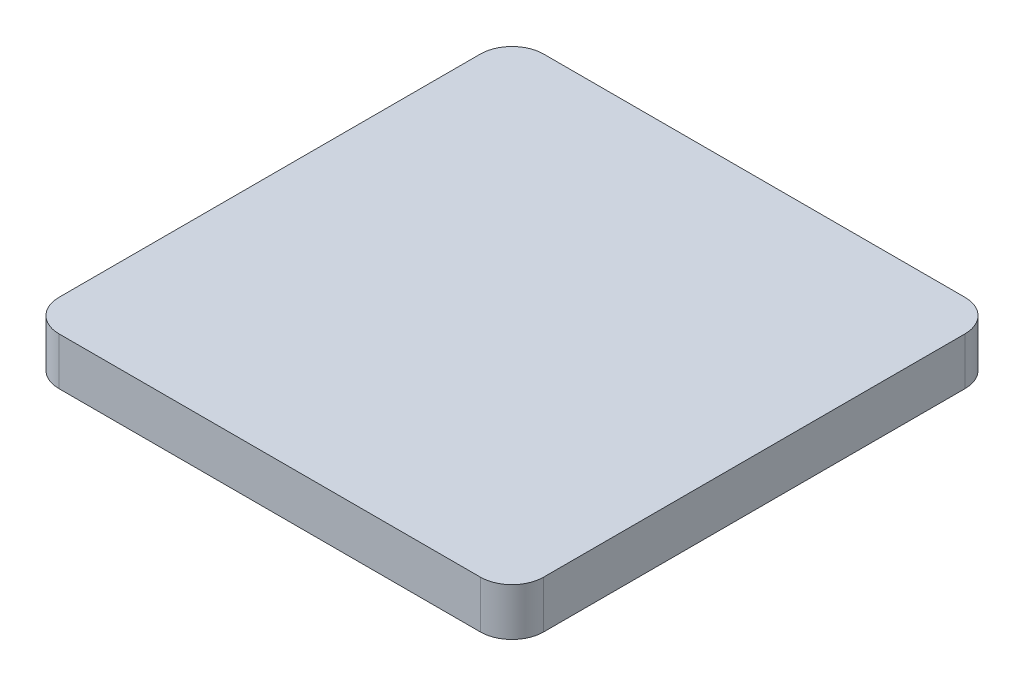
from build123d import *

# Parameters (mm, degrees)
SKETCH_1_W      = 15.3
SKETCH_1_H      = 15.3
EXTRUDE_1_DEPTH = 1.5
FILLET_1_R      = 1


with BuildPart() as part:
    # Sketch 1 → Extrude 1 (new body)
    with BuildSketch(Plane(origin=(0, 0, 0), x_dir=(1, 0, 0), z_dir=(0, 1, 0))):
        Rectangle(SKETCH_1_W, SKETCH_1_H)
    extrude(amount=EXTRUDE_1_DEPTH)

    # Fillet 1
    fillet_1_edges = [part.edges().sort_by_distance(p)[0] for p in [
        (7.65, 0.75, 7.65),
        (-7.65, 0.75, 7.65),
        (-7.65, 0.75, -7.65),
        (7.65, 0.75, -7.65),
    ]]
    fillet(fillet_1_edges, radius=FILLET_1_R)


solid = part.part
